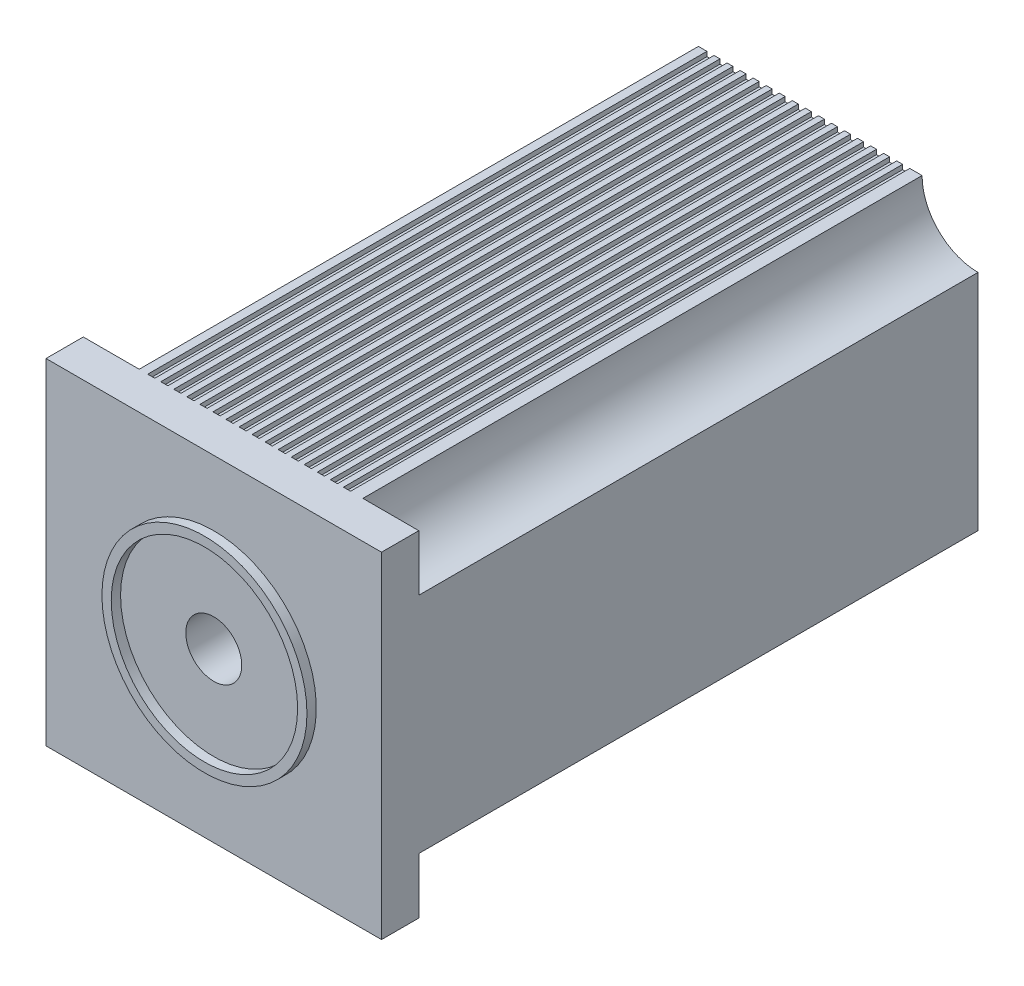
from build123d import *

# Parameters (mm, degrees)
BOSS_EXTRUDE1_DEPTH      = 20
BOSS_EXTRUDE1_DEPTH_BACK = 300
SKETCH1_W                = 180
SKETCH1_H                = 180
SKETCH2_R                = 30
CUT_EXTRUDE1_DEPTH       = 371
SKETCH3_W                = 3.794835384
SKETCH3_H                = 4.427307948
CUT_EXTRUDE2_DEPTH       = 351
LPATTERN1_COUNT          = 16
LPATTERN1_PITCH          = 7
SKETCH4_W                = 3.24409051
SKETCH4_H                = 3.24409051
CUT_EXTRUDE3_DEPTH       = 477
LPATTERN2_COUNT          = 17
LPATTERN2_PITCH          = 7
SKETCH5_R                = 55
SKETCH5_R_2              = 50
BOSS_EXTRUDE2_DEPTH      = 25
CUT_EXTRUDE4_DEPTH       = 87
CUT_EXTRUDE4_DEPTH_BACK  = 400
SKETCH6_R                = 15


with BuildPart() as part:
    # Sketch1 → Boss-Extrude1 (new, two sides: drawn at the far end of the back side and taken through both)
    with BuildSketch(Plane.XY.offset(-BOSS_EXTRUDE1_DEPTH_BACK)):
        Rectangle(SKETCH1_W, SKETCH1_H)
    extrude(amount=BOSS_EXTRUDE1_DEPTH + BOSS_EXTRUDE1_DEPTH_BACK)

    # Sketch2 → Cut-Extrude1 (cut)
    with BuildSketch(Plane.XY):
        with Locations((90, 90)):
            Circle(SKETCH2_R)
        with Locations((-90, 90)):
            Circle(SKETCH2_R)
        with Locations((-90, -90)):
            Circle(SKETCH2_R)
        with Locations((90, -90)):
            Circle(SKETCH2_R)
    extrude(amount=-CUT_EXTRUDE1_DEPTH, mode=Mode.SUBTRACT)

    # Sketch3 → Cut-Extrude2 (cut)
    with BuildSketch(Plane.XY):
        with Locations((-53.518616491, 89.724616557)):
            Rectangle(SKETCH3_W, SKETCH3_H)
    cut_extrude2 = extrude(amount=-CUT_EXTRUDE2_DEPTH, mode=Mode.SUBTRACT)

    # LPattern1: Cut-Extrude2 ×16
    with Locations(*[(i * LPATTERN1_PITCH, 0, 0) for i in range(1, LPATTERN1_COUNT)]):
        add(cut_extrude2, mode=Mode.SUBTRACT)

    # Sketch4 → Cut-Extrude3 (cut)
    with BuildSketch(Plane.XY):
        with Locations((-56.307701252, -90.366641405)):
            Rectangle(SKETCH4_W, SKETCH4_H)
    cut_extrude3 = extrude(amount=-CUT_EXTRUDE3_DEPTH, mode=Mode.SUBTRACT)

    # LPattern2: Cut-Extrude3 ×17
    with Locations(*[(i * LPATTERN2_PITCH, 0, 0) for i in range(1, LPATTERN2_COUNT)]):
        add(cut_extrude3, mode=Mode.SUBTRACT)

    # Sketch5 → Boss-Extrude2 (add)
    with BuildSketch(Plane.XY):
        with Locations(Location((0, 0, 0), (0, 0, 180))):
            Circle(SKETCH5_R)
        with Locations(Location((0, 0, 0), (0, 0, 180))):
            Circle(SKETCH5_R_2, mode=Mode.SUBTRACT)
    extrude(amount=BOSS_EXTRUDE2_DEPTH)

    # Sketch6 → Cut-Extrude4 (cut, two sides: drawn at the far end of the back side and taken through both)
    with BuildSketch(Plane.XY.offset(-CUT_EXTRUDE4_DEPTH_BACK)):
        with Locations(Location((0, 0, 0), (0, 0, 180))):
            Circle(SKETCH6_R)
    extrude(amount=CUT_EXTRUDE4_DEPTH + CUT_EXTRUDE4_DEPTH_BACK, mode=Mode.SUBTRACT)

    # Sketch7 → Revolve3 (revolve)
    with BuildSketch(Plane(origin=(0, 0, 0), x_dir=(0, 0, -1), z_dir=(1, 0, 0)), mode=Mode.PRIVATE) as revolve3_sk:
        Polygon((300, 64.436530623), (305.268286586, 64.436530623), (305.268286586, 67.349403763), (312.613792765, 67.349403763), (317.426365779, 65.892967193), (315.435296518, 64.827041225), (315.435296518, 63.296710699), (300, 63.296710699), align=None)
    revolve(revolve3_sk.sketch.rotate(Axis((0, 63.296710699, -315.435296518), (0, 0, 1)), 90), axis=Axis((0, 63.296710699, -315.435296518), (0, 0, 1)))


solid = part.part
